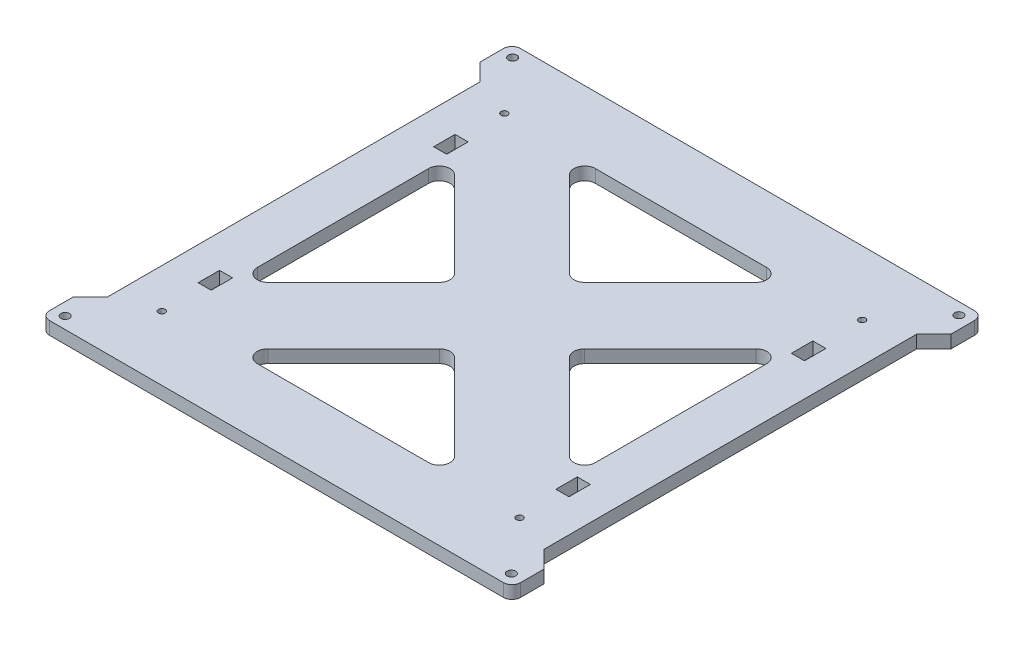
from build123d import *

# Parameters (mm, degrees)
SKETCH_1_R          = 2
SKETCH_1_W          = 6.1
SKETCH_1_H          = 10
EXTRUDE_1_DEPTH     = 6
SKETCH_2_R          = 1.55
CUT_EXTRUDE_1_DEPTH = 156.679157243
FILLET_1_R          = 4


with BuildPart() as part:
    # Sketch 1 → Extrude 1 (new body)
    with BuildSketch(Plane(origin=(0, 0, 0), x_dir=(1, 0, 0), z_dir=(0, 1, 0))):
        Polygon((110, 95), (102, 87), (102, -87), (110, -95), (110, -110), (-110, -110), (-110, -95), (-102, -87), (-102, 87), (-110, 95), (-110, 110), (110, 110), align=None)
        with Locations(Location((104.2, 104.5, 0), (0, 0, 270))):
            Circle(SKETCH_1_R, mode=Mode.SUBTRACT)
        with Locations(Location((-104.2, 104.5, 0), (0, 0, 90))):
            Circle(SKETCH_1_R, mode=Mode.SUBTRACT)
        with Locations(Location((104.2, -104.5, 0), (0, 0, 90))):
            Circle(SKETCH_1_R, mode=Mode.SUBTRACT)
        with Locations(Location((-104.2, -104.5, 0), (0, 0, 270))):
            Circle(SKETCH_1_R, mode=Mode.SUBTRACT)
        with BuildLine():
            Line((-40, 78.941125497), (40, 78.941125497))
            ThreePointArc((40, 78.941125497), (44.619397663, 75.854542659), (43.535533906, 70.405591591))
            Line((43.535533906, 70.405591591), (3.535533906, 30.405591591))
            ThreePointArc((3.535533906, 30.405591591), (0, 28.941125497), (-3.535533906, 30.405591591))
            Line((-3.535533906, 30.405591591), (-43.535533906, 70.405591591))
            ThreePointArc((-43.535533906, 70.405591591), (-44.619397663, 75.854542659), (-40, 78.941125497))
        make_face(mode=Mode.SUBTRACT)
        with BuildLine():
            Line((78.941125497, 40), (78.941125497, -40))
            ThreePointArc((78.941125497, -40), (75.854542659, -44.619397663), (70.405591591, -43.535533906))
            Line((70.405591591, -43.535533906), (30.405591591, -3.535533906))
            ThreePointArc((30.405591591, -3.535533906), (28.941125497, 0), (30.405591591, 3.535533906))
            Line((30.405591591, 3.535533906), (70.405591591, 43.535533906))
            ThreePointArc((70.405591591, 43.535533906), (75.854542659, 44.619397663), (78.941125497, 40))
        make_face(mode=Mode.SUBTRACT)
        with BuildLine():
            Line((40, -78.941125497), (-40, -78.941125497))
            ThreePointArc((-40, -78.941125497), (-44.619397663, -75.854542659), (-43.535533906, -70.405591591))
            Line((-43.535533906, -70.405591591), (-3.535533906, -30.405591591))
            ThreePointArc((-3.535533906, -30.405591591), (0, -28.941125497), (3.535533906, -30.405591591))
            Line((3.535533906, -30.405591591), (43.535533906, -70.405591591))
            ThreePointArc((43.535533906, -70.405591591), (44.619397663, -75.854542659), (40, -78.941125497))
        make_face(mode=Mode.SUBTRACT)
        with BuildLine():
            Line((-78.941125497, -40), (-78.941125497, 40))
            ThreePointArc((-78.941125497, 40), (-75.854542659, 44.619397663), (-70.405591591, 43.535533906))
            Line((-70.405591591, 43.535533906), (-30.405591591, 3.535533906))
            ThreePointArc((-30.405591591, 3.535533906), (-28.941125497, 0), (-30.405591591, -3.535533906))
            Line((-30.405591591, -3.535533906), (-70.405591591, -43.535533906))
            ThreePointArc((-70.405591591, -43.535533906), (-75.854542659, -44.619397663), (-78.941125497, -40))
        make_face(mode=Mode.SUBTRACT)
        with Locations((83.55, -55)):
            Rectangle(SKETCH_1_W, SKETCH_1_H, mode=Mode.SUBTRACT)
        with Locations((83.55, 55)):
            Rectangle(SKETCH_1_W, SKETCH_1_H, mode=Mode.SUBTRACT)
        with Locations((-83.55, -55)):
            Rectangle(SKETCH_1_W, SKETCH_1_H, mode=Mode.SUBTRACT)
        with Locations((-83.55, 55)):
            Rectangle(SKETCH_1_W, SKETCH_1_H, mode=Mode.SUBTRACT)
    extrude(amount=EXTRUDE_1_DEPTH)

    # Sketch 2 → Cut-Extrude 1 (cut, through all)
    with BuildSketch(Plane(origin=(0, 6, 0), x_dir=(1, 0, 0), z_dir=(0, 1, 0))):
        with Locations(Location((83.55, 80, 0), (0, 0, 270))):
            Circle(SKETCH_2_R)
        with Locations(Location((83.55, -80, 0), (0, 0, 90))):
            Circle(SKETCH_2_R)
        with Locations(Location((-83.55, -80, 0), (0, 0, 270))):
            Circle(SKETCH_2_R)
        with Locations(Location((-83.55, 80, 0), (0, 0, 90))):
            Circle(SKETCH_2_R)
    extrude(amount=-CUT_EXTRUDE_1_DEPTH, mode=Mode.SUBTRACT)

    # Fillet 1
    fillet_1_edges = [part.edges().sort_by_distance(p)[0] for p in [
        (110, 3, 110),
        (-110, 3, 110),
        (-110, 3, -110),
        (110, 3, -110),
    ]]
    fillet(fillet_1_edges, radius=FILLET_1_R)


solid = part.part
